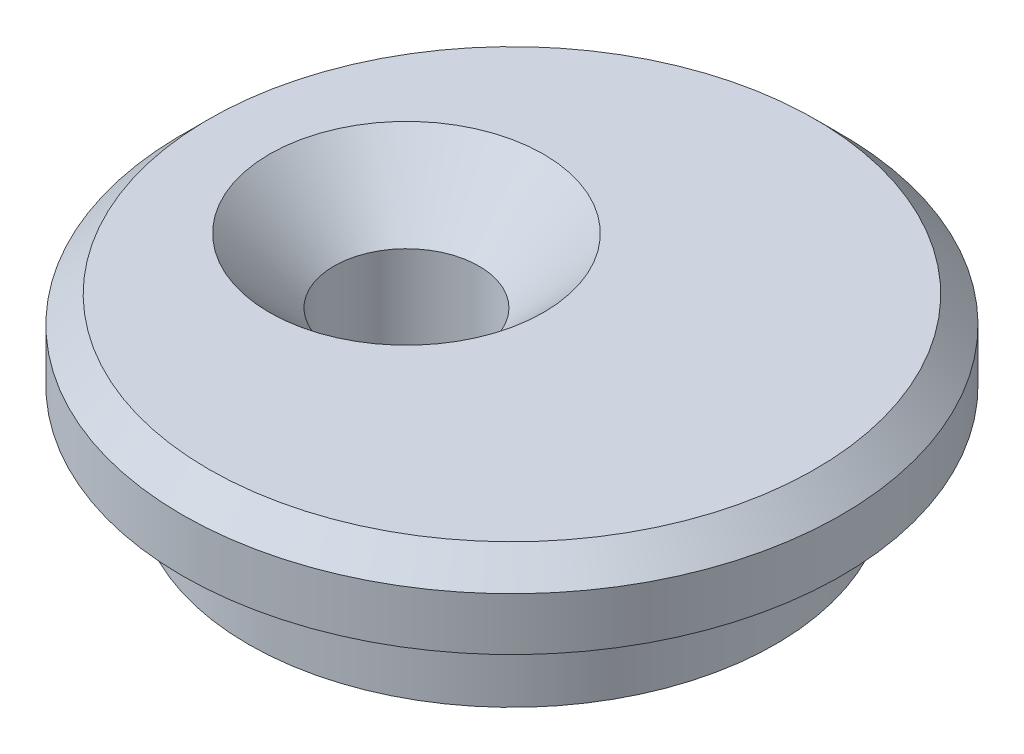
ISO-10303-21;
HEADER;
FILE_DESCRIPTION(('STEP AP214'),'2;1');
FILE_NAME('part.step','',(''),(''),'','','');
FILE_SCHEMA(('AUTOMOTIVE_DESIGN { 1 0 10303 214 1 1 1 1 }'));
ENDSEC;
DATA;
#1=APPLICATION_CONTEXT('core data for automotive mechanical design processes');
#2=APPLICATION_PROTOCOL_DEFINITION('international standard','automotive_design',2000,#1);
#3=PRODUCT_CONTEXT('',#1,'mechanical');
#4=PRODUCT('Part','Part','',(#3));
#5=PRODUCT_RELATED_PRODUCT_CATEGORY('part','',(#4));
#6=PRODUCT_DEFINITION_FORMATION('','',#4);
#7=PRODUCT_DEFINITION_CONTEXT('part definition',#1,'design');
#8=PRODUCT_DEFINITION('design','',#6,#7);
#9=PRODUCT_DEFINITION_SHAPE('','',#8);
#10=(LENGTH_UNIT() NAMED_UNIT(*) SI_UNIT(.MILLI.,.METRE.));
#11=(NAMED_UNIT(*) PLANE_ANGLE_UNIT() SI_UNIT($,.RADIAN.));
#12=(NAMED_UNIT(*) SI_UNIT($,.STERADIAN.) SOLID_ANGLE_UNIT());
#13=UNCERTAINTY_MEASURE_WITH_UNIT(LENGTH_MEASURE(1.E-05),#10,'distance_accuracy_value','');
#14=(GEOMETRIC_REPRESENTATION_CONTEXT(3) GLOBAL_UNCERTAINTY_ASSIGNED_CONTEXT((#13)) GLOBAL_UNIT_ASSIGNED_CONTEXT((#10,
#11,#12)) REPRESENTATION_CONTEXT('',''));
#15=CARTESIAN_POINT('',(0.,0.,0.));
#16=DIRECTION('',(0.,0.,1.));
#17=DIRECTION('',(1.,0.,0.));
#18=AXIS2_PLACEMENT_3D('',#15,#16,#17);
#19=CARTESIAN_POINT('',(0.,3.5,0.));
#20=DIRECTION('',(0.,-1.,0.));
#21=DIRECTION('',(0.,0.,-1.));
#22=AXIS2_PLACEMENT_3D('',#19,#20,#21);
#23=CYLINDRICAL_SURFACE('',#22,10.);
#24=CARTESIAN_POINT('',(0.,3.5,0.));
#25=DIRECTION('',(0.,1.,0.));
#26=DIRECTION('',(0.,0.,1.));
#27=AXIS2_PLACEMENT_3D('',#24,#25,#26);
#28=CIRCLE('',#27,10.);
#29=CARTESIAN_POINT('',(0.,3.5,10.));
#30=VERTEX_POINT('',#29);
#31=EDGE_CURVE('E40',#30,#30,#28,.T.);
#32=ORIENTED_EDGE('',*,*,#31,.F.);
#33=EDGE_LOOP('',(#32));
#34=FACE_BOUND('',#33,.T.);
#35=CARTESIAN_POINT('',(0.,0.,0.));
#36=DIRECTION('',(0.,1.,0.));
#37=DIRECTION('',(0.,0.,1.));
#38=AXIS2_PLACEMENT_3D('',#35,#36,#37);
#39=CIRCLE('',#38,10.);
#40=CARTESIAN_POINT('',(0.,0.,10.));
#41=VERTEX_POINT('',#40);
#42=EDGE_CURVE('E44',#41,#41,#39,.T.);
#43=ORIENTED_EDGE('',*,*,#42,.T.);
#44=EDGE_LOOP('',(#43));
#45=FACE_BOUND('',#44,.T.);
#46=ADVANCED_FACE('F29',(#34,#45),#23,.T.);
#47=CARTESIAN_POINT('',(0.,0.,0.));
#48=DIRECTION('',(0.,1.,0.));
#49=DIRECTION('',(0.,0.,1.));
#50=AXIS2_PLACEMENT_3D('',#47,#48,#49);
#51=PLANE('',#50);
#52=CARTESIAN_POINT('',(-4.,0.,0.));
#53=DIRECTION('',(0.,1.,0.));
#54=DIRECTION('',(0.,0.,1.));
#55=AXIS2_PLACEMENT_3D('',#52,#53,#54);
#56=CIRCLE('',#55,2.75);
#57=CARTESIAN_POINT('',(-4.,0.,2.75));
#58=VERTEX_POINT('',#57);
#59=EDGE_CURVE('E52',#58,#58,#56,.T.);
#60=ORIENTED_EDGE('',*,*,#59,.T.);
#61=EDGE_LOOP('',(#60));
#62=FACE_BOUND('',#61,.T.);
#63=ORIENTED_EDGE('',*,*,#42,.F.);
#64=EDGE_LOOP('',(#63));
#65=FACE_BOUND('',#64,.T.);
#66=ADVANCED_FACE('F79',(#62,#65),#51,.F.);
#67=CARTESIAN_POINT('',(0.,3.5,0.));
#68=DIRECTION('',(0.,1.,0.));
#69=DIRECTION('',(0.,0.,1.));
#70=AXIS2_PLACEMENT_3D('',#67,#68,#69);
#71=PLANE('',#70);
#72=CARTESIAN_POINT('',(0.,3.5,0.));
#73=DIRECTION('',(0.,1.,0.));
#74=DIRECTION('',(0.,0.,1.));
#75=AXIS2_PLACEMENT_3D('',#72,#73,#74);
#76=CIRCLE('',#75,12.5);
#77=CARTESIAN_POINT('',(0.,3.5,12.5));
#78=VERTEX_POINT('',#77);
#79=EDGE_CURVE('E48',#78,#78,#76,.T.);
#80=ORIENTED_EDGE('',*,*,#79,.F.);
#81=EDGE_LOOP('',(#80));
#82=FACE_BOUND('',#81,.T.);
#83=ORIENTED_EDGE('',*,*,#31,.T.);
#84=EDGE_LOOP('',(#83));
#85=FACE_BOUND('',#84,.T.);
#86=ADVANCED_FACE('F74',(#82,#85),#71,.F.);
#87=CARTESIAN_POINT('',(0.,6.5,0.));
#88=DIRECTION('',(0.,-1.,0.));
#89=DIRECTION('',(0.,0.,-1.));
#90=AXIS2_PLACEMENT_3D('',#87,#88,#89);
#91=CYLINDRICAL_SURFACE('',#90,12.5);
#92=CARTESIAN_POINT('',(0.,5.50000000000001,0.));
#93=DIRECTION('',(0.,1.,0.));
#94=DIRECTION('',(0.,0.,1.));
#95=AXIS2_PLACEMENT_3D('',#92,#93,#94);
#96=CIRCLE('',#95,12.5);
#97=CARTESIAN_POINT('',(0.,5.50000000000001,12.5));
#98=VERTEX_POINT('',#97);
#99=EDGE_CURVE('E10',#98,#98,#96,.F.);
#100=ORIENTED_EDGE('',*,*,#99,.T.);
#101=EDGE_LOOP('',(#100));
#102=FACE_BOUND('',#101,.T.);
#103=ORIENTED_EDGE('',*,*,#79,.T.);
#104=EDGE_LOOP('',(#103));
#105=FACE_BOUND('',#104,.T.);
#106=ADVANCED_FACE('F66',(#102,#105),#91,.T.);
#107=CARTESIAN_POINT('',(0.,6.5,0.));
#108=DIRECTION('',(0.,1.,0.));
#109=DIRECTION('',(0.,0.,1.));
#110=AXIS2_PLACEMENT_3D('',#107,#108,#109);
#111=PLANE('',#110);
#112=CARTESIAN_POINT('',(-4.,6.5,0.));
#113=DIRECTION('',(0.,1.,0.));
#114=DIRECTION('',(0.,0.,1.));
#115=AXIS2_PLACEMENT_3D('',#112,#113,#114);
#116=CIRCLE('',#115,5.2);
#117=CARTESIAN_POINT('',(-4.,6.5,5.2));
#118=VERTEX_POINT('',#117);
#119=EDGE_CURVE('E58',#118,#118,#116,.T.);
#120=ORIENTED_EDGE('',*,*,#119,.F.);
#121=EDGE_LOOP('',(#120));
#122=FACE_BOUND('',#121,.T.);
#123=CARTESIAN_POINT('',(0.,6.5,0.));
#124=DIRECTION('',(0.,1.,0.));
#125=DIRECTION('',(0.,0.,1.));
#126=AXIS2_PLACEMENT_3D('',#123,#124,#125);
#127=CIRCLE('',#126,11.5);
#128=CARTESIAN_POINT('',(0.,6.5,11.5));
#129=VERTEX_POINT('',#128);
#130=EDGE_CURVE('E36',#129,#129,#127,.T.);
#131=ORIENTED_EDGE('',*,*,#130,.T.);
#132=EDGE_LOOP('',(#131));
#133=FACE_BOUND('',#132,.T.);
#134=ADVANCED_FACE('F64',(#122,#133),#111,.T.);
#135=CARTESIAN_POINT('',(0.,6.5,0.));
#136=DIRECTION('',(0.,-1.,0.));
#137=DIRECTION('',(0.,0.,-1.));
#138=AXIS2_PLACEMENT_3D('',#135,#136,#137);
#139=CONICAL_SURFACE('',#138,11.5,0.785398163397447);
#140=ORIENTED_EDGE('',*,*,#99,.F.);
#141=EDGE_LOOP('',(#140));
#142=FACE_BOUND('',#141,.T.);
#143=ORIENTED_EDGE('',*,*,#130,.F.);
#144=EDGE_LOOP('',(#143));
#145=FACE_BOUND('',#144,.T.);
#146=ADVANCED_FACE('F31',(#142,#145),#139,.T.);
#147=CARTESIAN_POINT('',(-4.,6.5,0.));
#148=DIRECTION('',(0.,1.,0.));
#149=DIRECTION('',(0.,0.,1.));
#150=AXIS2_PLACEMENT_3D('',#147,#148,#149);
#151=CYLINDRICAL_SURFACE('',#150,2.75);
#152=ORIENTED_EDGE('',*,*,#59,.F.);
#153=EDGE_LOOP('',(#152));
#154=FACE_BOUND('',#153,.T.);
#155=CARTESIAN_POINT('',(-4.,4.05,0.));
#156=DIRECTION('',(0.,1.,0.));
#157=DIRECTION('',(0.,0.,1.));
#158=AXIS2_PLACEMENT_3D('',#155,#156,#157);
#159=CIRCLE('',#158,2.75);
#160=CARTESIAN_POINT('',(-4.,4.05,2.75));
#161=VERTEX_POINT('',#160);
#162=EDGE_CURVE('E55',#161,#161,#159,.T.);
#163=ORIENTED_EDGE('',*,*,#162,.T.);
#164=EDGE_LOOP('',(#163));
#165=FACE_BOUND('',#164,.T.);
#166=ADVANCED_FACE('F72',(#154,#165),#151,.F.);
#167=CARTESIAN_POINT('',(-4.,6.5,0.));
#168=DIRECTION('',(0.,1.,0.));
#169=DIRECTION('',(0.,0.,1.));
#170=AXIS2_PLACEMENT_3D('',#167,#168,#169);
#171=CONICAL_SURFACE('',#170,5.2,0.785398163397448);
#172=ORIENTED_EDGE('',*,*,#162,.F.);
#173=EDGE_LOOP('',(#172));
#174=FACE_BOUND('',#173,.T.);
#175=ORIENTED_EDGE('',*,*,#119,.T.);
#176=EDGE_LOOP('',(#175));
#177=FACE_BOUND('',#176,.T.);
#178=ADVANCED_FACE('F62',(#174,#177),#171,.F.);
#179=CLOSED_SHELL('',(#46,#66,#86,#106,#134,#146,#166,#178));
#180=MANIFOLD_SOLID_BREP('B2',#179);
#181=ADVANCED_BREP_SHAPE_REPRESENTATION('',(#18,#180),#14);
#182=SHAPE_DEFINITION_REPRESENTATION(#9,#181);
ENDSEC;
END-ISO-10303-21;
